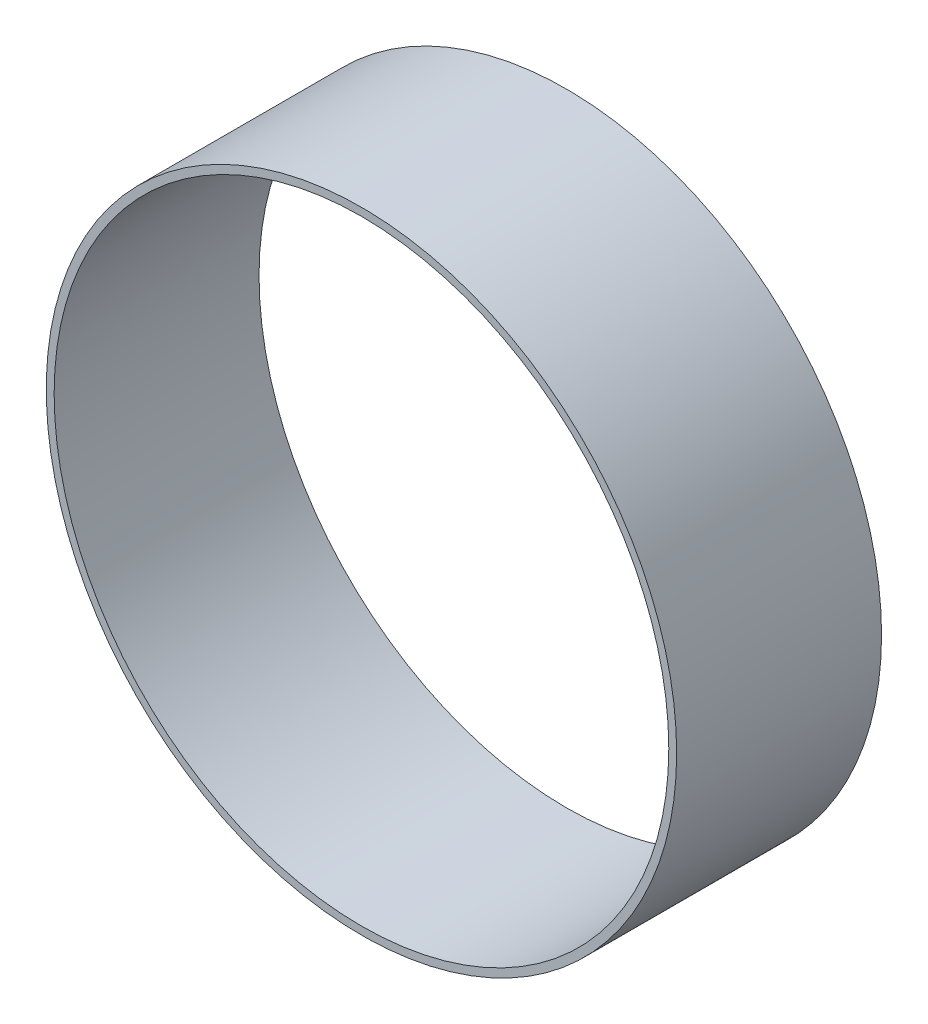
from build123d import *

# Parameters (mm, degrees)
SKETCH1_R           = 127
SKETCH1_R_2         = 123.825
BOSS_EXTRUDE1_DEPTH = 82.55


with BuildPart() as part:
    # Sketch1 → Boss-Extrude1 (new body)
    with BuildSketch(Plane.XY):
        Circle(SKETCH1_R)
        Circle(SKETCH1_R_2, mode=Mode.SUBTRACT)
    extrude(amount=BOSS_EXTRUDE1_DEPTH)


solid = part.part
